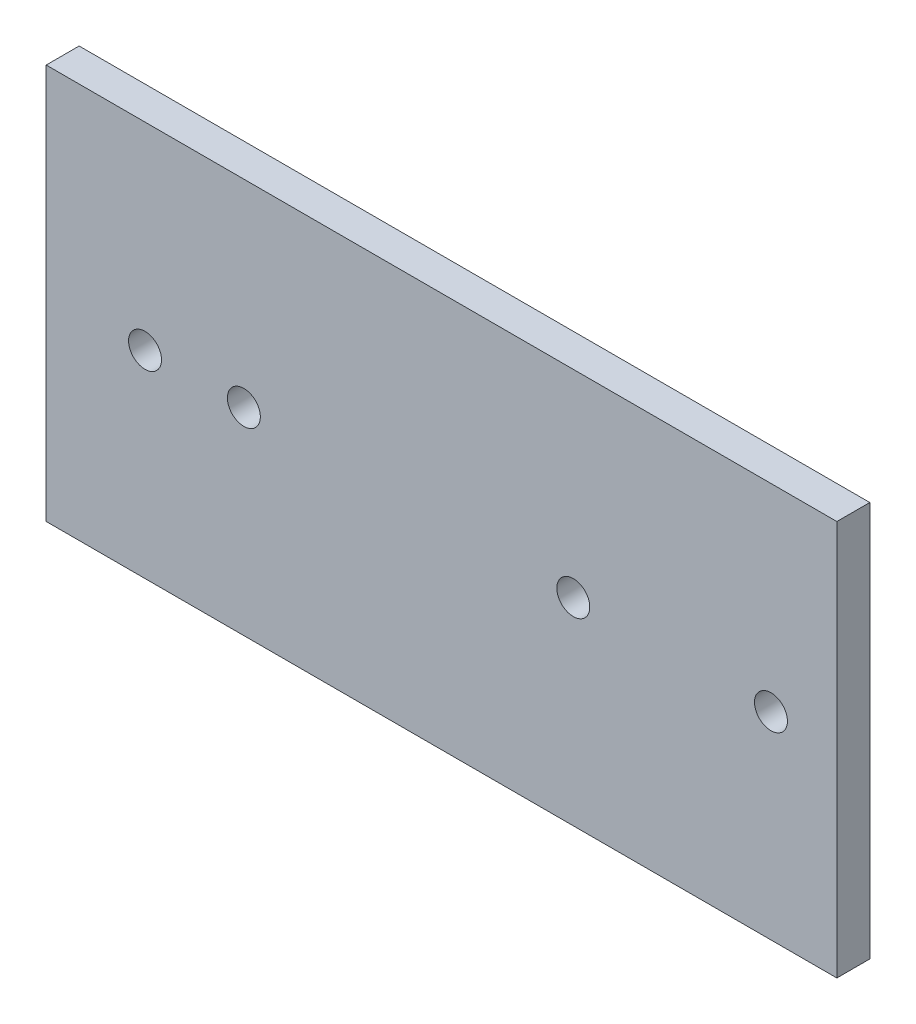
ISO-10303-21;
HEADER;
FILE_DESCRIPTION(('STEP AP214'),'2;1');
FILE_NAME('part.step','',(''),(''),'','','');
FILE_SCHEMA(('AUTOMOTIVE_DESIGN { 1 0 10303 214 1 1 1 1 }'));
ENDSEC;
DATA;
#1=APPLICATION_CONTEXT('core data for automotive mechanical design processes');
#2=APPLICATION_PROTOCOL_DEFINITION('international standard','automotive_design',2000,#1);
#3=PRODUCT_CONTEXT('',#1,'mechanical');
#4=PRODUCT('Part','Part','',(#3));
#5=PRODUCT_RELATED_PRODUCT_CATEGORY('part','',(#4));
#6=PRODUCT_DEFINITION_FORMATION('','',#4);
#7=PRODUCT_DEFINITION_CONTEXT('part definition',#1,'design');
#8=PRODUCT_DEFINITION('design','',#6,#7);
#9=PRODUCT_DEFINITION_SHAPE('','',#8);
#10=(LENGTH_UNIT() NAMED_UNIT(*) SI_UNIT(.MILLI.,.METRE.));
#11=(NAMED_UNIT(*) PLANE_ANGLE_UNIT() SI_UNIT($,.RADIAN.));
#12=(NAMED_UNIT(*) SI_UNIT($,.STERADIAN.) SOLID_ANGLE_UNIT());
#13=UNCERTAINTY_MEASURE_WITH_UNIT(LENGTH_MEASURE(1.E-05),#10,'distance_accuracy_value','');
#14=(GEOMETRIC_REPRESENTATION_CONTEXT(3) GLOBAL_UNCERTAINTY_ASSIGNED_CONTEXT((#13)) GLOBAL_UNIT_ASSIGNED_CONTEXT((#10,
#11,#12)) REPRESENTATION_CONTEXT('',''));
#15=CARTESIAN_POINT('',(0.,0.,0.));
#16=DIRECTION('',(0.,0.,1.));
#17=DIRECTION('',(1.,0.,0.));
#18=AXIS2_PLACEMENT_3D('',#15,#16,#17);
#19=CARTESIAN_POINT('',(-60.,-30.,5.));
#20=DIRECTION('',(-1.,0.,0.));
#21=DIRECTION('',(0.,0.,1.));
#22=AXIS2_PLACEMENT_3D('',#19,#20,#21);
#23=PLANE('',#22);
#24=DIRECTION('',(0.,1.,0.));
#25=VECTOR('',#24,1.);
#26=CARTESIAN_POINT('',(-60.,-30.,0.));
#27=LINE('',#26,#25);
#28=CARTESIAN_POINT('',(-60.,-30.,0.));
#29=VERTEX_POINT('',#28);
#30=CARTESIAN_POINT('',(-60.,30.,0.));
#31=VERTEX_POINT('',#30);
#32=EDGE_CURVE('E100',#29,#31,#27,.T.);
#33=ORIENTED_EDGE('',*,*,#32,.F.);
#34=DIRECTION('',(0.,0.,-1.));
#35=VECTOR('',#34,1.);
#36=CARTESIAN_POINT('',(-60.,-30.,5.));
#37=LINE('',#36,#35);
#38=CARTESIAN_POINT('',(-60.,-30.,5.));
#39=VERTEX_POINT('',#38);
#40=EDGE_CURVE('E11',#39,#29,#37,.T.);
#41=ORIENTED_EDGE('',*,*,#40,.F.);
#42=DIRECTION('',(0.,1.,0.));
#43=VECTOR('',#42,1.);
#44=CARTESIAN_POINT('',(-60.,-30.,5.));
#45=LINE('',#44,#43);
#46=CARTESIAN_POINT('',(-60.,30.,5.));
#47=VERTEX_POINT('',#46);
#48=EDGE_CURVE('E94',#39,#47,#45,.T.);
#49=ORIENTED_EDGE('',*,*,#48,.T.);
#50=DIRECTION('',(0.,0.,-1.));
#51=VECTOR('',#50,1.);
#52=CARTESIAN_POINT('',(-60.,30.,5.));
#53=LINE('',#52,#51);
#54=EDGE_CURVE('E37',#47,#31,#53,.T.);
#55=ORIENTED_EDGE('',*,*,#54,.T.);
#56=EDGE_LOOP('',(#33,#41,#49,#55));
#57=FACE_BOUND('',#56,.T.);
#58=ADVANCED_FACE('F34',(#57),#23,.T.);
#59=CARTESIAN_POINT('',(-60.,-30.,5.));
#60=DIRECTION('',(0.,1.,0.));
#61=DIRECTION('',(0.,0.,1.));
#62=AXIS2_PLACEMENT_3D('',#59,#60,#61);
#63=PLANE('',#62);
#64=DIRECTION('',(1.,0.,0.));
#65=VECTOR('',#64,1.);
#66=CARTESIAN_POINT('',(-60.,-30.,0.));
#67=LINE('',#66,#65);
#68=CARTESIAN_POINT('',(60.,-30.,0.));
#69=VERTEX_POINT('',#68);
#70=EDGE_CURVE('E67',#29,#69,#67,.T.);
#71=ORIENTED_EDGE('',*,*,#70,.T.);
#72=DIRECTION('',(0.,0.,-1.));
#73=VECTOR('',#72,1.);
#74=CARTESIAN_POINT('',(60.,-30.,5.));
#75=LINE('',#74,#73);
#76=CARTESIAN_POINT('',(60.,-30.,5.));
#77=VERTEX_POINT('',#76);
#78=EDGE_CURVE('E43',#77,#69,#75,.T.);
#79=ORIENTED_EDGE('',*,*,#78,.F.);
#80=DIRECTION('',(1.,0.,0.));
#81=VECTOR('',#80,1.);
#82=CARTESIAN_POINT('',(-60.,-30.,5.));
#83=LINE('',#82,#81);
#84=EDGE_CURVE('E84',#39,#77,#83,.T.);
#85=ORIENTED_EDGE('',*,*,#84,.F.);
#86=ORIENTED_EDGE('',*,*,#40,.T.);
#87=EDGE_LOOP('',(#71,#79,#85,#86));
#88=FACE_BOUND('',#87,.T.);
#89=ADVANCED_FACE('F111',(#88),#63,.F.);
#90=CARTESIAN_POINT('',(60.,-30.,5.));
#91=DIRECTION('',(-1.,0.,0.));
#92=DIRECTION('',(0.,0.,1.));
#93=AXIS2_PLACEMENT_3D('',#90,#91,#92);
#94=PLANE('',#93);
#95=DIRECTION('',(0.,1.,0.));
#96=VECTOR('',#95,1.);
#97=CARTESIAN_POINT('',(60.,-30.,0.));
#98=LINE('',#97,#96);
#99=CARTESIAN_POINT('',(60.,30.,0.));
#100=VERTEX_POINT('',#99);
#101=EDGE_CURVE('E91',#69,#100,#98,.T.);
#102=ORIENTED_EDGE('',*,*,#101,.T.);
#103=DIRECTION('',(0.,0.,-1.));
#104=VECTOR('',#103,1.);
#105=CARTESIAN_POINT('',(60.,30.,5.));
#106=LINE('',#105,#104);
#107=CARTESIAN_POINT('',(60.,30.,5.));
#108=VERTEX_POINT('',#107);
#109=EDGE_CURVE('E88',#108,#100,#106,.T.);
#110=ORIENTED_EDGE('',*,*,#109,.F.);
#111=DIRECTION('',(0.,1.,0.));
#112=VECTOR('',#111,1.);
#113=CARTESIAN_POINT('',(60.,-30.,5.));
#114=LINE('',#113,#112);
#115=EDGE_CURVE('E79',#77,#108,#114,.T.);
#116=ORIENTED_EDGE('',*,*,#115,.F.);
#117=ORIENTED_EDGE('',*,*,#78,.T.);
#118=EDGE_LOOP('',(#102,#110,#116,#117));
#119=FACE_BOUND('',#118,.T.);
#120=ADVANCED_FACE('F89',(#119),#94,.F.);
#121=CARTESIAN_POINT('',(-60.,30.,5.));
#122=DIRECTION('',(0.,1.,0.));
#123=DIRECTION('',(0.,0.,1.));
#124=AXIS2_PLACEMENT_3D('',#121,#122,#123);
#125=PLANE('',#124);
#126=DIRECTION('',(1.,0.,0.));
#127=VECTOR('',#126,1.);
#128=CARTESIAN_POINT('',(-60.,30.,0.));
#129=LINE('',#128,#127);
#130=EDGE_CURVE('E103',#31,#100,#129,.T.);
#131=ORIENTED_EDGE('',*,*,#130,.F.);
#132=ORIENTED_EDGE('',*,*,#54,.F.);
#133=DIRECTION('',(1.,0.,0.));
#134=VECTOR('',#133,1.);
#135=CARTESIAN_POINT('',(-60.,30.,5.));
#136=LINE('',#135,#134);
#137=EDGE_CURVE('E83',#47,#108,#136,.T.);
#138=ORIENTED_EDGE('',*,*,#137,.T.);
#139=ORIENTED_EDGE('',*,*,#109,.T.);
#140=EDGE_LOOP('',(#131,#132,#138,#139));
#141=FACE_BOUND('',#140,.T.);
#142=ADVANCED_FACE('F93',(#141),#125,.T.);
#143=CARTESIAN_POINT('',(0.,0.,5.));
#144=DIRECTION('',(0.,0.,-1.));
#145=DIRECTION('',(-1.,0.,0.));
#146=AXIS2_PLACEMENT_3D('',#143,#144,#145);
#147=PLANE('',#146);
#148=CARTESIAN_POINT('',(50.,0.,5.));
#149=DIRECTION('',(0.,0.,-1.));
#150=DIRECTION('',(-1.,0.,0.));
#151=AXIS2_PLACEMENT_3D('',#148,#149,#150);
#152=CIRCLE('',#151,2.49999999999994);
#153=CARTESIAN_POINT('',(47.5000000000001,0.,5.));
#154=VERTEX_POINT('',#153);
#155=EDGE_CURVE('E153',#154,#154,#152,.T.);
#156=ORIENTED_EDGE('',*,*,#155,.T.);
#157=EDGE_LOOP('',(#156));
#158=FACE_BOUND('',#157,.T.);
#159=CARTESIAN_POINT('',(20.,0.,5.));
#160=DIRECTION('',(0.,0.,-1.));
#161=DIRECTION('',(-1.,0.,0.));
#162=AXIS2_PLACEMENT_3D('',#159,#160,#161);
#163=CIRCLE('',#162,2.49999999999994);
#164=CARTESIAN_POINT('',(17.5000000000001,0.,5.));
#165=VERTEX_POINT('',#164);
#166=EDGE_CURVE('E163',#165,#165,#163,.T.);
#167=ORIENTED_EDGE('',*,*,#166,.T.);
#168=EDGE_LOOP('',(#167));
#169=FACE_BOUND('',#168,.T.);
#170=CARTESIAN_POINT('',(-30.,0.,5.));
#171=DIRECTION('',(0.,0.,-1.));
#172=DIRECTION('',(-1.,0.,0.));
#173=AXIS2_PLACEMENT_3D('',#170,#171,#172);
#174=CIRCLE('',#173,2.49999999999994);
#175=CARTESIAN_POINT('',(-32.4999999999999,0.,5.));
#176=VERTEX_POINT('',#175);
#177=EDGE_CURVE('E169',#176,#176,#174,.T.);
#178=ORIENTED_EDGE('',*,*,#177,.T.);
#179=EDGE_LOOP('',(#178));
#180=FACE_BOUND('',#179,.T.);
#181=CARTESIAN_POINT('',(-45.,0.,5.));
#182=DIRECTION('',(0.,0.,-1.));
#183=DIRECTION('',(-1.,0.,0.));
#184=AXIS2_PLACEMENT_3D('',#181,#182,#183);
#185=CIRCLE('',#184,2.49999999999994);
#186=CARTESIAN_POINT('',(-47.4999999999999,0.,5.));
#187=VERTEX_POINT('',#186);
#188=EDGE_CURVE('E104',#187,#187,#185,.T.);
#189=ORIENTED_EDGE('',*,*,#188,.T.);
#190=EDGE_LOOP('',(#189));
#191=FACE_BOUND('',#190,.T.);
#192=ORIENTED_EDGE('',*,*,#48,.F.);
#193=ORIENTED_EDGE('',*,*,#84,.T.);
#194=ORIENTED_EDGE('',*,*,#115,.T.);
#195=ORIENTED_EDGE('',*,*,#137,.F.);
#196=EDGE_LOOP('',(#192,#193,#194,#195));
#197=FACE_BOUND('',#196,.T.);
#198=ADVANCED_FACE('F82',(#158,#169,#180,#191,#197),#147,.F.);
#199=CARTESIAN_POINT('',(0.,0.,0.));
#200=DIRECTION('',(0.,0.,-1.));
#201=DIRECTION('',(-1.,0.,0.));
#202=AXIS2_PLACEMENT_3D('',#199,#200,#201);
#203=PLANE('',#202);
#204=CARTESIAN_POINT('',(50.,0.,0.));
#205=DIRECTION('',(0.,0.,-1.));
#206=DIRECTION('',(-1.,0.,0.));
#207=AXIS2_PLACEMENT_3D('',#204,#205,#206);
#208=CIRCLE('',#207,2.49999999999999);
#209=CARTESIAN_POINT('',(47.5,0.,0.));
#210=VERTEX_POINT('',#209);
#211=EDGE_CURVE('E156',#210,#210,#208,.T.);
#212=ORIENTED_EDGE('',*,*,#211,.F.);
#213=EDGE_LOOP('',(#212));
#214=FACE_BOUND('',#213,.T.);
#215=CARTESIAN_POINT('',(20.,0.,0.));
#216=DIRECTION('',(0.,0.,-1.));
#217=DIRECTION('',(-1.,0.,0.));
#218=AXIS2_PLACEMENT_3D('',#215,#216,#217);
#219=CIRCLE('',#218,2.49999999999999);
#220=CARTESIAN_POINT('',(17.5,0.,0.));
#221=VERTEX_POINT('',#220);
#222=EDGE_CURVE('E158',#221,#221,#219,.T.);
#223=ORIENTED_EDGE('',*,*,#222,.F.);
#224=EDGE_LOOP('',(#223));
#225=FACE_BOUND('',#224,.T.);
#226=CARTESIAN_POINT('',(-30.,0.,0.));
#227=DIRECTION('',(0.,0.,-1.));
#228=DIRECTION('',(-1.,0.,0.));
#229=AXIS2_PLACEMENT_3D('',#226,#227,#228);
#230=CIRCLE('',#229,2.49999999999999);
#231=CARTESIAN_POINT('',(-32.5,0.,0.));
#232=VERTEX_POINT('',#231);
#233=EDGE_CURVE('E166',#232,#232,#230,.T.);
#234=ORIENTED_EDGE('',*,*,#233,.F.);
#235=EDGE_LOOP('',(#234));
#236=FACE_BOUND('',#235,.T.);
#237=CARTESIAN_POINT('',(-45.,0.,0.));
#238=DIRECTION('',(0.,0.,-1.));
#239=DIRECTION('',(-1.,0.,0.));
#240=AXIS2_PLACEMENT_3D('',#237,#238,#239);
#241=CIRCLE('',#240,2.49999999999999);
#242=CARTESIAN_POINT('',(-47.5,0.,0.));
#243=VERTEX_POINT('',#242);
#244=EDGE_CURVE('E172',#243,#243,#241,.T.);
#245=ORIENTED_EDGE('',*,*,#244,.F.);
#246=EDGE_LOOP('',(#245));
#247=FACE_BOUND('',#246,.T.);
#248=ORIENTED_EDGE('',*,*,#32,.T.);
#249=ORIENTED_EDGE('',*,*,#130,.T.);
#250=ORIENTED_EDGE('',*,*,#101,.F.);
#251=ORIENTED_EDGE('',*,*,#70,.F.);
#252=EDGE_LOOP('',(#248,#249,#250,#251));
#253=FACE_BOUND('',#252,.T.);
#254=ADVANCED_FACE('F109',(#214,#225,#236,#247,#253),#203,.T.);
#255=CARTESIAN_POINT('',(-45.,0.,0.));
#256=DIRECTION('',(0.,0.,-1.));
#257=DIRECTION('',(-1.,0.,0.));
#258=AXIS2_PLACEMENT_3D('',#255,#256,#257);
#259=CYLINDRICAL_SURFACE('',#258,2.49999999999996);
#260=ORIENTED_EDGE('',*,*,#188,.F.);
#261=EDGE_LOOP('',(#260));
#262=FACE_BOUND('',#261,.T.);
#263=ORIENTED_EDGE('',*,*,#244,.T.);
#264=EDGE_LOOP('',(#263));
#265=FACE_BOUND('',#264,.T.);
#266=ADVANCED_FACE('F130',(#262,#265),#259,.F.);
#267=CARTESIAN_POINT('',(-30.,0.,0.));
#268=DIRECTION('',(0.,0.,-1.));
#269=DIRECTION('',(-1.,0.,0.));
#270=AXIS2_PLACEMENT_3D('',#267,#268,#269);
#271=CYLINDRICAL_SURFACE('',#270,2.49999999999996);
#272=ORIENTED_EDGE('',*,*,#177,.F.);
#273=EDGE_LOOP('',(#272));
#274=FACE_BOUND('',#273,.T.);
#275=ORIENTED_EDGE('',*,*,#233,.T.);
#276=EDGE_LOOP('',(#275));
#277=FACE_BOUND('',#276,.T.);
#278=ADVANCED_FACE('F137',(#274,#277),#271,.F.);
#279=CARTESIAN_POINT('',(20.,0.,0.));
#280=DIRECTION('',(0.,0.,-1.));
#281=DIRECTION('',(-1.,0.,0.));
#282=AXIS2_PLACEMENT_3D('',#279,#280,#281);
#283=CYLINDRICAL_SURFACE('',#282,2.49999999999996);
#284=ORIENTED_EDGE('',*,*,#166,.F.);
#285=EDGE_LOOP('',(#284));
#286=FACE_BOUND('',#285,.T.);
#287=ORIENTED_EDGE('',*,*,#222,.T.);
#288=EDGE_LOOP('',(#287));
#289=FACE_BOUND('',#288,.T.);
#290=ADVANCED_FACE('F141',(#286,#289),#283,.F.);
#291=CARTESIAN_POINT('',(50.,0.,0.));
#292=DIRECTION('',(0.,0.,-1.));
#293=DIRECTION('',(-1.,0.,0.));
#294=AXIS2_PLACEMENT_3D('',#291,#292,#293);
#295=CYLINDRICAL_SURFACE('',#294,2.49999999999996);
#296=ORIENTED_EDGE('',*,*,#155,.F.);
#297=EDGE_LOOP('',(#296));
#298=FACE_BOUND('',#297,.T.);
#299=ORIENTED_EDGE('',*,*,#211,.T.);
#300=EDGE_LOOP('',(#299));
#301=FACE_BOUND('',#300,.T.);
#302=ADVANCED_FACE('F145',(#298,#301),#295,.F.);
#303=CLOSED_SHELL('',(#58,#89,#120,#142,#198,#254,#266,#278,#290,#302));
#304=MANIFOLD_SOLID_BREP('B2',#303);
#305=ADVANCED_BREP_SHAPE_REPRESENTATION('',(#18,#304),#14);
#306=SHAPE_DEFINITION_REPRESENTATION(#9,#305);
ENDSEC;
END-ISO-10303-21;
